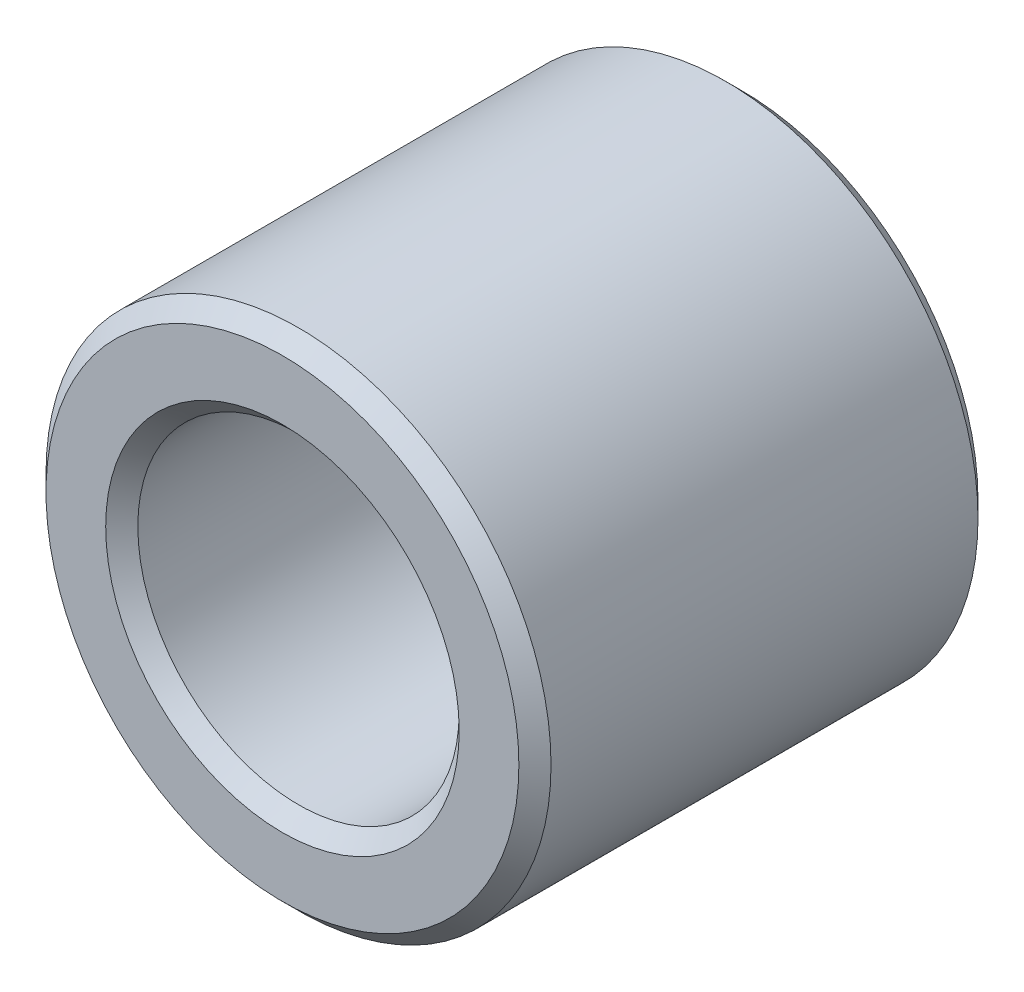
ISO-10303-21;
HEADER;
FILE_DESCRIPTION(('STEP AP214'),'2;1');
FILE_NAME('part.step','',(''),(''),'','','');
FILE_SCHEMA(('AUTOMOTIVE_DESIGN { 1 0 10303 214 1 1 1 1 }'));
ENDSEC;
DATA;
#1=APPLICATION_CONTEXT('core data for automotive mechanical design processes');
#2=APPLICATION_PROTOCOL_DEFINITION('international standard','automotive_design',2000,#1);
#3=PRODUCT_CONTEXT('',#1,'mechanical');
#4=PRODUCT('Part','Part','',(#3));
#5=PRODUCT_RELATED_PRODUCT_CATEGORY('part','',(#4));
#6=PRODUCT_DEFINITION_FORMATION('','',#4);
#7=PRODUCT_DEFINITION_CONTEXT('part definition',#1,'design');
#8=PRODUCT_DEFINITION('design','',#6,#7);
#9=PRODUCT_DEFINITION_SHAPE('','',#8);
#10=(LENGTH_UNIT() NAMED_UNIT(*) SI_UNIT(.MILLI.,.METRE.));
#11=(NAMED_UNIT(*) PLANE_ANGLE_UNIT() SI_UNIT($,.RADIAN.));
#12=(NAMED_UNIT(*) SI_UNIT($,.STERADIAN.) SOLID_ANGLE_UNIT());
#13=UNCERTAINTY_MEASURE_WITH_UNIT(LENGTH_MEASURE(1.E-05),#10,'distance_accuracy_value','');
#14=(GEOMETRIC_REPRESENTATION_CONTEXT(3) GLOBAL_UNCERTAINTY_ASSIGNED_CONTEXT((#13)) GLOBAL_UNIT_ASSIGNED_CONTEXT((#10,
#11,#12)) REPRESENTATION_CONTEXT('',''));
#15=CARTESIAN_POINT('',(0.,0.,0.));
#16=DIRECTION('',(0.,0.,1.));
#17=DIRECTION('',(1.,0.,0.));
#18=AXIS2_PLACEMENT_3D('',#15,#16,#17);
#19=CARTESIAN_POINT('',(0.,0.,50.));
#20=DIRECTION('',(0.,0.,1.));
#21=DIRECTION('',(1.,0.,0.));
#22=AXIS2_PLACEMENT_3D('',#19,#20,#21);
#23=PLANE('',#22);
#24=CARTESIAN_POINT('',(0.,0.,50.));
#25=DIRECTION('',(0.,0.,1.));
#26=DIRECTION('',(1.,0.,0.));
#27=AXIS2_PLACEMENT_3D('',#24,#25,#26);
#28=CIRCLE('',#27,38.5);
#29=CARTESIAN_POINT('',(38.5,0.,50.));
#30=VERTEX_POINT('',#29);
#31=EDGE_CURVE('E10',#30,#30,#28,.F.);
#32=ORIENTED_EDGE('',*,*,#31,.T.);
#33=EDGE_LOOP('',(#32));
#34=FACE_BOUND('',#33,.T.);
#35=CARTESIAN_POINT('',(0.,0.,50.));
#36=DIRECTION('',(0.,0.,1.));
#37=DIRECTION('',(1.,0.,0.));
#38=AXIS2_PLACEMENT_3D('',#35,#36,#37);
#39=CIRCLE('',#38,51.5);
#40=CARTESIAN_POINT('',(51.5,0.,50.));
#41=VERTEX_POINT('',#40);
#42=EDGE_CURVE('E45',#41,#41,#39,.T.);
#43=ORIENTED_EDGE('',*,*,#42,.T.);
#44=EDGE_LOOP('',(#43));
#45=FACE_BOUND('',#44,.T.);
#46=ADVANCED_FACE('F37',(#34,#45),#23,.T.);
#47=CARTESIAN_POINT('',(0.,0.,-50.));
#48=DIRECTION('',(0.,0.,1.));
#49=DIRECTION('',(1.,0.,0.));
#50=AXIS2_PLACEMENT_3D('',#47,#48,#49);
#51=PLANE('',#50);
#52=CARTESIAN_POINT('',(0.,0.,-50.));
#53=DIRECTION('',(0.,0.,1.));
#54=DIRECTION('',(1.,0.,0.));
#55=AXIS2_PLACEMENT_3D('',#52,#53,#54);
#56=CIRCLE('',#55,38.5);
#57=CARTESIAN_POINT('',(-38.5,0.,-50.));
#58=VERTEX_POINT('',#57);
#59=EDGE_CURVE('E70',#58,#58,#56,.T.);
#60=ORIENTED_EDGE('',*,*,#59,.T.);
#61=EDGE_LOOP('',(#60));
#62=FACE_BOUND('',#61,.T.);
#63=CARTESIAN_POINT('',(0.,0.,-50.));
#64=DIRECTION('',(0.,0.,1.));
#65=DIRECTION('',(1.,0.,0.));
#66=AXIS2_PLACEMENT_3D('',#63,#64,#65);
#67=CIRCLE('',#66,51.5);
#68=CARTESIAN_POINT('',(51.5,0.,-50.));
#69=VERTEX_POINT('',#68);
#70=EDGE_CURVE('E73',#69,#69,#67,.F.);
#71=ORIENTED_EDGE('',*,*,#70,.T.);
#72=EDGE_LOOP('',(#71));
#73=FACE_BOUND('',#72,.T.);
#74=ADVANCED_FACE('F78',(#62,#73),#51,.F.);
#75=CARTESIAN_POINT('',(0.,0.,50.));
#76=DIRECTION('',(0.,0.,-1.));
#77=DIRECTION('',(-1.,0.,0.));
#78=AXIS2_PLACEMENT_3D('',#75,#76,#77);
#79=CYLINDRICAL_SURFACE('',#78,55.);
#80=CARTESIAN_POINT('',(0.,0.,-46.5));
#81=DIRECTION('',(0.,0.,1.));
#82=DIRECTION('',(1.,0.,0.));
#83=AXIS2_PLACEMENT_3D('',#80,#81,#82);
#84=CIRCLE('',#83,55.);
#85=CARTESIAN_POINT('',(55.,0.,-46.5));
#86=VERTEX_POINT('',#85);
#87=EDGE_CURVE('E52',#86,#86,#84,.T.);
#88=ORIENTED_EDGE('',*,*,#87,.T.);
#89=EDGE_LOOP('',(#88));
#90=FACE_BOUND('',#89,.T.);
#91=CARTESIAN_POINT('',(0.,0.,46.5));
#92=DIRECTION('',(0.,0.,1.));
#93=DIRECTION('',(1.,0.,0.));
#94=AXIS2_PLACEMENT_3D('',#91,#92,#93);
#95=CIRCLE('',#94,55.);
#96=CARTESIAN_POINT('',(55.,0.,46.5));
#97=VERTEX_POINT('',#96);
#98=EDGE_CURVE('E58',#97,#97,#95,.F.);
#99=ORIENTED_EDGE('',*,*,#98,.T.);
#100=EDGE_LOOP('',(#99));
#101=FACE_BOUND('',#100,.T.);
#102=ADVANCED_FACE('F88',(#90,#101),#79,.T.);
#103=CARTESIAN_POINT('',(0.,0.,50.));
#104=DIRECTION('',(0.,0.,-1.));
#105=DIRECTION('',(-1.,0.,0.));
#106=AXIS2_PLACEMENT_3D('',#103,#104,#105);
#107=CYLINDRICAL_SURFACE('',#106,35.);
#108=CARTESIAN_POINT('',(0.,0.,-46.5));
#109=DIRECTION('',(0.,0.,1.));
#110=DIRECTION('',(1.,0.,0.));
#111=AXIS2_PLACEMENT_3D('',#108,#109,#110);
#112=CIRCLE('',#111,35.);
#113=CARTESIAN_POINT('',(-35.,0.,-46.5));
#114=VERTEX_POINT('',#113);
#115=EDGE_CURVE('E64',#114,#114,#112,.F.);
#116=CARTESIAN_POINT('',(0.,0.,46.5));
#117=DIRECTION('',(0.,0.,1.));
#118=DIRECTION('',(1.,0.,0.));
#119=AXIS2_PLACEMENT_3D('',#116,#117,#118);
#120=CIRCLE('',#119,35.);
#121=CARTESIAN_POINT('',(-35.,0.,46.5));
#122=VERTEX_POINT('',#121);
#123=EDGE_CURVE('E67',#122,#122,#120,.T.);
#124=CARTESIAN_POINT('',(-35.,0.,-46.5));
#125=CARTESIAN_POINT('',(-35.,0.,-45.53125));
#126=CARTESIAN_POINT('',(-35.,0.,-44.5625));
#127=CARTESIAN_POINT('',(-35.,0.,-42.625));
#128=CARTESIAN_POINT('',(-35.,0.,-41.65625));
#129=CARTESIAN_POINT('',(-35.,0.,-39.71875));
#130=CARTESIAN_POINT('',(-35.,0.,-38.75));
#131=CARTESIAN_POINT('',(-35.,0.,-36.8125));
#132=CARTESIAN_POINT('',(-35.,0.,-35.84375));
#133=CARTESIAN_POINT('',(-35.,0.,-33.90625));
#134=CARTESIAN_POINT('',(-35.,0.,-32.9375));
#135=CARTESIAN_POINT('',(-35.,0.,-31.));
#136=CARTESIAN_POINT('',(-35.,0.,-30.03125));
#137=CARTESIAN_POINT('',(-35.,0.,-28.09375));
#138=CARTESIAN_POINT('',(-35.,0.,-27.125));
#139=CARTESIAN_POINT('',(-35.,0.,-25.1875));
#140=CARTESIAN_POINT('',(-35.,0.,-24.21875));
#141=CARTESIAN_POINT('',(-35.,0.,-22.28125));
#142=CARTESIAN_POINT('',(-35.,0.,-21.3125));
#143=CARTESIAN_POINT('',(-35.,0.,-19.375));
#144=CARTESIAN_POINT('',(-35.,0.,-18.40625));
#145=CARTESIAN_POINT('',(-35.,0.,-16.46875));
#146=CARTESIAN_POINT('',(-35.,0.,-15.5));
#147=CARTESIAN_POINT('',(-35.,0.,-13.5625));
#148=CARTESIAN_POINT('',(-35.,0.,-12.59375));
#149=CARTESIAN_POINT('',(-35.,0.,-10.65625));
#150=CARTESIAN_POINT('',(-35.,0.,-9.6875));
#151=CARTESIAN_POINT('',(-35.,0.,-7.75));
#152=CARTESIAN_POINT('',(-35.,0.,-6.78125000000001));
#153=CARTESIAN_POINT('',(-35.,0.,-4.84375000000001));
#154=CARTESIAN_POINT('',(-35.,0.,-3.87500000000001));
#155=CARTESIAN_POINT('',(-35.,0.,-1.93750000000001));
#156=CARTESIAN_POINT('',(-35.,0.,-0.968750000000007));
#157=CARTESIAN_POINT('',(-35.,0.,0.968749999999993));
#158=CARTESIAN_POINT('',(-35.,0.,1.93749999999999));
#159=CARTESIAN_POINT('',(-35.,0.,3.87499999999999));
#160=CARTESIAN_POINT('',(-35.,0.,4.84374999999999));
#161=CARTESIAN_POINT('',(-35.,0.,6.78124999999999));
#162=CARTESIAN_POINT('',(-35.,0.,7.74999999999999));
#163=CARTESIAN_POINT('',(-35.,0.,9.68749999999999));
#164=CARTESIAN_POINT('',(-35.,0.,10.65625));
#165=CARTESIAN_POINT('',(-35.,0.,12.59375));
#166=CARTESIAN_POINT('',(-35.,0.,13.5625));
#167=CARTESIAN_POINT('',(-35.,0.,15.5));
#168=CARTESIAN_POINT('',(-35.,0.,16.46875));
#169=CARTESIAN_POINT('',(-35.,0.,18.40625));
#170=CARTESIAN_POINT('',(-35.,0.,19.375));
#171=CARTESIAN_POINT('',(-35.,0.,21.3125));
#172=CARTESIAN_POINT('',(-35.,0.,22.28125));
#173=CARTESIAN_POINT('',(-35.,0.,24.21875));
#174=CARTESIAN_POINT('',(-35.,0.,25.1875));
#175=CARTESIAN_POINT('',(-35.,0.,27.125));
#176=CARTESIAN_POINT('',(-35.,0.,28.09375));
#177=CARTESIAN_POINT('',(-35.,0.,30.03125));
#178=CARTESIAN_POINT('',(-35.,0.,31.));
#179=CARTESIAN_POINT('',(-35.,0.,32.9375));
#180=CARTESIAN_POINT('',(-35.,0.,33.90625));
#181=CARTESIAN_POINT('',(-35.,0.,35.84375));
#182=CARTESIAN_POINT('',(-35.,0.,36.8125));
#183=CARTESIAN_POINT('',(-35.,0.,38.75));
#184=CARTESIAN_POINT('',(-35.,0.,39.71875));
#185=CARTESIAN_POINT('',(-35.,0.,41.65625));
#186=CARTESIAN_POINT('',(-35.,0.,42.625));
#187=CARTESIAN_POINT('',(-35.,0.,44.5625));
#188=CARTESIAN_POINT('',(-35.,0.,45.53125));
#189=CARTESIAN_POINT('',(-35.,0.,46.5));
#190=B_SPLINE_CURVE_WITH_KNOTS('',3,(#124,#125,#126,#127,#128,#129,#130,#131,#132,#133,#134,
#135,#136,#137,#138,#139,#140,#141,#142,#143,#144,#145,#146,#147,#148,#149,#150,#151,#152,#153,
#154,#155,#156,#157,#158,#159,#160,#161,#162,#163,#164,#165,#166,#167,#168,#169,#170,#171,#172,
#173,#174,#175,#176,#177,#178,#179,#180,#181,#182,#183,#184,#185,#186,#187,#188,#189),
.UNSPECIFIED.,.F.,.F.,(4,2,2,2,2,2,2,2,2,2,2,2,2,2,2,2,2,2,2,2,2,2,2,2,2,2,2,2,2,2,2,2,4),(0.,
2.90625,5.8125,8.71875,11.625,14.53125,17.4375,20.34375,23.25,26.15625,29.0625,31.96875,34.875,
37.78125,40.6875,43.59375,46.5,49.40625,52.3125,55.21875,58.125,61.03125,63.9375,66.84375,69.75,
72.65625,75.5625,78.46875,81.375,84.28125,87.1875,90.09375,93.),.UNSPECIFIED.);
#191=EDGE_CURVE('BSEAM91',#114,#122,#190,.T.);
#192=ORIENTED_EDGE('',*,*,#115,.T.);
#193=ORIENTED_EDGE('',*,*,#123,.T.);
#194=ORIENTED_EDGE('',*,*,#191,.T.);
#195=ORIENTED_EDGE('',*,*,#191,.F.);
#196=EDGE_LOOP('',(#192,#194,#193,#195));
#197=FACE_BOUND('',#196,.T.);
#198=ADVANCED_FACE('F91',(#197),#107,.F.);
#199=CARTESIAN_POINT('',(0.,0.,-50.));
#200=DIRECTION('',(0.,0.,-1.));
#201=DIRECTION('',(-1.,0.,0.));
#202=AXIS2_PLACEMENT_3D('',#199,#200,#201);
#203=CONICAL_SURFACE('',#202,38.5,0.785398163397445);
#204=CARTESIAN_POINT('',(-35.,0.,-46.5));
#205=CARTESIAN_POINT('',(-35.0364583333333,0.,-46.5364583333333));
#206=CARTESIAN_POINT('',(-35.0729166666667,0.,-46.5729166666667));
#207=CARTESIAN_POINT('',(-35.1458333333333,0.,-46.6458333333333));
#208=CARTESIAN_POINT('',(-35.1822916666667,0.,-46.6822916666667));
#209=CARTESIAN_POINT('',(-35.2552083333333,0.,-46.7552083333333));
#210=CARTESIAN_POINT('',(-35.2916666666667,0.,-46.7916666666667));
#211=CARTESIAN_POINT('',(-35.3645833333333,0.,-46.8645833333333));
#212=CARTESIAN_POINT('',(-35.4010416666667,0.,-46.9010416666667));
#213=CARTESIAN_POINT('',(-35.4739583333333,0.,-46.9739583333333));
#214=CARTESIAN_POINT('',(-35.5104166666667,0.,-47.0104166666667));
#215=CARTESIAN_POINT('',(-35.5833333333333,0.,-47.0833333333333));
#216=CARTESIAN_POINT('',(-35.6197916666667,0.,-47.1197916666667));
#217=CARTESIAN_POINT('',(-35.6927083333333,0.,-47.1927083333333));
#218=CARTESIAN_POINT('',(-35.7291666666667,0.,-47.2291666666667));
#219=CARTESIAN_POINT('',(-35.8020833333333,0.,-47.3020833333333));
#220=CARTESIAN_POINT('',(-35.8385416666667,0.,-47.3385416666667));
#221=CARTESIAN_POINT('',(-35.9114583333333,0.,-47.4114583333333));
#222=CARTESIAN_POINT('',(-35.9479166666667,0.,-47.4479166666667));
#223=CARTESIAN_POINT('',(-36.0208333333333,0.,-47.5208333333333));
#224=CARTESIAN_POINT('',(-36.0572916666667,0.,-47.5572916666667));
#225=CARTESIAN_POINT('',(-36.1302083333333,0.,-47.6302083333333));
#226=CARTESIAN_POINT('',(-36.1666666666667,0.,-47.6666666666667));
#227=CARTESIAN_POINT('',(-36.2395833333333,0.,-47.7395833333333));
#228=CARTESIAN_POINT('',(-36.2760416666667,0.,-47.7760416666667));
#229=CARTESIAN_POINT('',(-36.3489583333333,0.,-47.8489583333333));
#230=CARTESIAN_POINT('',(-36.3854166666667,0.,-47.8854166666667));
#231=CARTESIAN_POINT('',(-36.4583333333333,0.,-47.9583333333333));
#232=CARTESIAN_POINT('',(-36.4947916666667,0.,-47.9947916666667));
#233=CARTESIAN_POINT('',(-36.5677083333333,0.,-48.0677083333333));
#234=CARTESIAN_POINT('',(-36.6041666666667,0.,-48.1041666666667));
#235=CARTESIAN_POINT('',(-36.6770833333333,0.,-48.1770833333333));
#236=CARTESIAN_POINT('',(-36.7135416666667,0.,-48.2135416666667));
#237=CARTESIAN_POINT('',(-36.7864583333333,0.,-48.2864583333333));
#238=CARTESIAN_POINT('',(-36.8229166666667,0.,-48.3229166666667));
#239=CARTESIAN_POINT('',(-36.8958333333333,0.,-48.3958333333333));
#240=CARTESIAN_POINT('',(-36.9322916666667,0.,-48.4322916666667));
#241=CARTESIAN_POINT('',(-37.0052083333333,0.,-48.5052083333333));
#242=CARTESIAN_POINT('',(-37.0416666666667,0.,-48.5416666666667));
#243=CARTESIAN_POINT('',(-37.1145833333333,0.,-48.6145833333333));
#244=CARTESIAN_POINT('',(-37.1510416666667,0.,-48.6510416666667));
#245=CARTESIAN_POINT('',(-37.2239583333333,0.,-48.7239583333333));
#246=CARTESIAN_POINT('',(-37.2604166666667,0.,-48.7604166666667));
#247=CARTESIAN_POINT('',(-37.3333333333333,0.,-48.8333333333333));
#248=CARTESIAN_POINT('',(-37.3697916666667,0.,-48.8697916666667));
#249=CARTESIAN_POINT('',(-37.4427083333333,0.,-48.9427083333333));
#250=CARTESIAN_POINT('',(-37.4791666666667,0.,-48.9791666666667));
#251=CARTESIAN_POINT('',(-37.5520833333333,0.,-49.0520833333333));
#252=CARTESIAN_POINT('',(-37.5885416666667,0.,-49.0885416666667));
#253=CARTESIAN_POINT('',(-37.6614583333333,0.,-49.1614583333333));
#254=CARTESIAN_POINT('',(-37.6979166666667,0.,-49.1979166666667));
#255=CARTESIAN_POINT('',(-37.7708333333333,0.,-49.2708333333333));
#256=CARTESIAN_POINT('',(-37.8072916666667,0.,-49.3072916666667));
#257=CARTESIAN_POINT('',(-37.8802083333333,0.,-49.3802083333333));
#258=CARTESIAN_POINT('',(-37.9166666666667,0.,-49.4166666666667));
#259=CARTESIAN_POINT('',(-37.9895833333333,0.,-49.4895833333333));
#260=CARTESIAN_POINT('',(-38.0260416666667,0.,-49.5260416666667));
#261=CARTESIAN_POINT('',(-38.0989583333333,0.,-49.5989583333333));
#262=CARTESIAN_POINT('',(-38.1354166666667,0.,-49.6354166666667));
#263=CARTESIAN_POINT('',(-38.2083333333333,0.,-49.7083333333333));
#264=CARTESIAN_POINT('',(-38.2447916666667,0.,-49.7447916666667));
#265=CARTESIAN_POINT('',(-38.3177083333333,0.,-49.8177083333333));
#266=CARTESIAN_POINT('',(-38.3541666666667,0.,-49.8541666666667));
#267=CARTESIAN_POINT('',(-38.4270833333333,0.,-49.9270833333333));
#268=CARTESIAN_POINT('',(-38.4635416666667,0.,-49.9635416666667));
#269=CARTESIAN_POINT('',(-38.5,0.,-50.));
#270=B_SPLINE_CURVE_WITH_KNOTS('',3,(#204,#205,#206,#207,#208,#209,#210,#211,#212,#213,#214,
#215,#216,#217,#218,#219,#220,#221,#222,#223,#224,#225,#226,#227,#228,#229,#230,#231,#232,#233,
#234,#235,#236,#237,#238,#239,#240,#241,#242,#243,#244,#245,#246,#247,#248,#249,#250,#251,#252,
#253,#254,#255,#256,#257,#258,#259,#260,#261,#262,#263,#264,#265,#266,#267,#268,#269),
.UNSPECIFIED.,.F.,.F.,(4,2,2,2,2,2,2,2,2,2,2,2,2,2,2,2,2,2,2,2,2,2,2,2,2,2,2,2,2,2,2,2,4),(0.,
0.15467960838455,0.30935921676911,0.46403882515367,0.618718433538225,0.77339804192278,
0.928077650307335,1.08275725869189,1.23743686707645,1.392116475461,1.54679608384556,
1.70147569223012,1.85615530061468,2.01083490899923,2.16551451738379,2.32019412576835,
2.47487373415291,2.62955334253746,2.78423295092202,2.93891255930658,3.09359216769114,
3.24827177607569,3.40295138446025,3.55763099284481,3.71231060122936,3.86699020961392,
4.02166981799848,4.17634942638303,4.33102903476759,4.48570864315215,4.6403882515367,
4.79506785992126,4.94974746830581),.UNSPECIFIED.);
#271=EDGE_CURVE('BSEAM84',#114,#58,#270,.T.);
#272=ORIENTED_EDGE('',*,*,#115,.F.);
#273=ORIENTED_EDGE('',*,*,#59,.F.);
#274=ORIENTED_EDGE('',*,*,#271,.T.);
#275=ORIENTED_EDGE('',*,*,#271,.F.);
#276=EDGE_LOOP('',(#272,#274,#273,#275));
#277=FACE_BOUND('',#276,.T.);
#278=ADVANCED_FACE('F84',(#277),#203,.F.);
#279=CARTESIAN_POINT('',(0.,0.,-46.5));
#280=DIRECTION('',(0.,0.,1.));
#281=DIRECTION('',(1.,0.,0.));
#282=AXIS2_PLACEMENT_3D('',#279,#280,#281);
#283=CONICAL_SURFACE('',#282,55.,0.785398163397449);
#284=CARTESIAN_POINT('',(51.5,0.,-50.));
#285=CARTESIAN_POINT('',(51.5364583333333,0.,-49.9635416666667));
#286=CARTESIAN_POINT('',(51.5729166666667,0.,-49.9270833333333));
#287=CARTESIAN_POINT('',(51.6458333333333,0.,-49.8541666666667));
#288=CARTESIAN_POINT('',(51.6822916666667,0.,-49.8177083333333));
#289=CARTESIAN_POINT('',(51.7552083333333,0.,-49.7447916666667));
#290=CARTESIAN_POINT('',(51.7916666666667,0.,-49.7083333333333));
#291=CARTESIAN_POINT('',(51.8645833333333,0.,-49.6354166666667));
#292=CARTESIAN_POINT('',(51.9010416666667,0.,-49.5989583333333));
#293=CARTESIAN_POINT('',(51.9739583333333,0.,-49.5260416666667));
#294=CARTESIAN_POINT('',(52.0104166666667,0.,-49.4895833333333));
#295=CARTESIAN_POINT('',(52.0833333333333,0.,-49.4166666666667));
#296=CARTESIAN_POINT('',(52.1197916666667,0.,-49.3802083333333));
#297=CARTESIAN_POINT('',(52.1927083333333,0.,-49.3072916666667));
#298=CARTESIAN_POINT('',(52.2291666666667,0.,-49.2708333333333));
#299=CARTESIAN_POINT('',(52.3020833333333,0.,-49.1979166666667));
#300=CARTESIAN_POINT('',(52.3385416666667,0.,-49.1614583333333));
#301=CARTESIAN_POINT('',(52.4114583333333,0.,-49.0885416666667));
#302=CARTESIAN_POINT('',(52.4479166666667,0.,-49.0520833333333));
#303=CARTESIAN_POINT('',(52.5208333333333,0.,-48.9791666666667));
#304=CARTESIAN_POINT('',(52.5572916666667,0.,-48.9427083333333));
#305=CARTESIAN_POINT('',(52.6302083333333,0.,-48.8697916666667));
#306=CARTESIAN_POINT('',(52.6666666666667,0.,-48.8333333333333));
#307=CARTESIAN_POINT('',(52.7395833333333,0.,-48.7604166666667));
#308=CARTESIAN_POINT('',(52.7760416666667,0.,-48.7239583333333));
#309=CARTESIAN_POINT('',(52.8489583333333,0.,-48.6510416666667));
#310=CARTESIAN_POINT('',(52.8854166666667,0.,-48.6145833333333));
#311=CARTESIAN_POINT('',(52.9583333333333,0.,-48.5416666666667));
#312=CARTESIAN_POINT('',(52.9947916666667,0.,-48.5052083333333));
#313=CARTESIAN_POINT('',(53.0677083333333,0.,-48.4322916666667));
#314=CARTESIAN_POINT('',(53.1041666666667,0.,-48.3958333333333));
#315=CARTESIAN_POINT('',(53.1770833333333,0.,-48.3229166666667));
#316=CARTESIAN_POINT('',(53.2135416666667,0.,-48.2864583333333));
#317=CARTESIAN_POINT('',(53.2864583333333,0.,-48.2135416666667));
#318=CARTESIAN_POINT('',(53.3229166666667,0.,-48.1770833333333));
#319=CARTESIAN_POINT('',(53.3958333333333,0.,-48.1041666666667));
#320=CARTESIAN_POINT('',(53.4322916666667,0.,-48.0677083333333));
#321=CARTESIAN_POINT('',(53.5052083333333,0.,-47.9947916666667));
#322=CARTESIAN_POINT('',(53.5416666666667,0.,-47.9583333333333));
#323=CARTESIAN_POINT('',(53.6145833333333,0.,-47.8854166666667));
#324=CARTESIAN_POINT('',(53.6510416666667,0.,-47.8489583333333));
#325=CARTESIAN_POINT('',(53.7239583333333,0.,-47.7760416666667));
#326=CARTESIAN_POINT('',(53.7604166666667,0.,-47.7395833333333));
#327=CARTESIAN_POINT('',(53.8333333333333,0.,-47.6666666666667));
#328=CARTESIAN_POINT('',(53.8697916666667,0.,-47.6302083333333));
#329=CARTESIAN_POINT('',(53.9427083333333,0.,-47.5572916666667));
#330=CARTESIAN_POINT('',(53.9791666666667,0.,-47.5208333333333));
#331=CARTESIAN_POINT('',(54.0520833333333,0.,-47.4479166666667));
#332=CARTESIAN_POINT('',(54.0885416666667,0.,-47.4114583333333));
#333=CARTESIAN_POINT('',(54.1614583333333,0.,-47.3385416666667));
#334=CARTESIAN_POINT('',(54.1979166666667,0.,-47.3020833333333));
#335=CARTESIAN_POINT('',(54.2708333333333,0.,-47.2291666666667));
#336=CARTESIAN_POINT('',(54.3072916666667,0.,-47.1927083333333));
#337=CARTESIAN_POINT('',(54.3802083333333,0.,-47.1197916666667));
#338=CARTESIAN_POINT('',(54.4166666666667,0.,-47.0833333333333));
#339=CARTESIAN_POINT('',(54.4895833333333,0.,-47.0104166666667));
#340=CARTESIAN_POINT('',(54.5260416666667,0.,-46.9739583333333));
#341=CARTESIAN_POINT('',(54.5989583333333,0.,-46.9010416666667));
#342=CARTESIAN_POINT('',(54.6354166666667,0.,-46.8645833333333));
#343=CARTESIAN_POINT('',(54.7083333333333,0.,-46.7916666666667));
#344=CARTESIAN_POINT('',(54.7447916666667,0.,-46.7552083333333));
#345=CARTESIAN_POINT('',(54.8177083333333,0.,-46.6822916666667));
#346=CARTESIAN_POINT('',(54.8541666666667,0.,-46.6458333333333));
#347=CARTESIAN_POINT('',(54.9270833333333,0.,-46.5729166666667));
#348=CARTESIAN_POINT('',(54.9635416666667,0.,-46.5364583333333));
#349=CARTESIAN_POINT('',(55.,0.,-46.5));
#350=B_SPLINE_CURVE_WITH_KNOTS('',3,(#284,#285,#286,#287,#288,#289,#290,#291,#292,#293,#294,
#295,#296,#297,#298,#299,#300,#301,#302,#303,#304,#305,#306,#307,#308,#309,#310,#311,#312,#313,
#314,#315,#316,#317,#318,#319,#320,#321,#322,#323,#324,#325,#326,#327,#328,#329,#330,#331,#332,
#333,#334,#335,#336,#337,#338,#339,#340,#341,#342,#343,#344,#345,#346,#347,#348,#349),
.UNSPECIFIED.,.F.,.F.,(4,2,2,2,2,2,2,2,2,2,2,2,2,2,2,2,2,2,2,2,2,2,2,2,2,2,2,2,2,2,2,2,4),(0.,
0.15467960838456,0.30935921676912,0.46403882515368,0.61871843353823,0.77339804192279,
0.928077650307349,1.08275725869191,1.23743686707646,1.39211647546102,1.54679608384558,
1.70147569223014,1.85615530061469,2.01083490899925,2.16551451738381,2.32019412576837,
2.47487373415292,2.62955334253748,2.78423295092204,2.9389125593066,3.09359216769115,
3.24827177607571,3.40295138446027,3.55763099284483,3.71231060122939,3.86699020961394,
4.0216698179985,4.17634942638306,4.33102903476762,4.48570864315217,4.64038825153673,
4.79506785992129,4.94974746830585),.UNSPECIFIED.);
#351=EDGE_CURVE('BSEAM80',#69,#86,#350,.T.);
#352=ORIENTED_EDGE('',*,*,#70,.F.);
#353=ORIENTED_EDGE('',*,*,#87,.F.);
#354=ORIENTED_EDGE('',*,*,#351,.T.);
#355=ORIENTED_EDGE('',*,*,#351,.F.);
#356=EDGE_LOOP('',(#352,#354,#353,#355));
#357=FACE_BOUND('',#356,.T.);
#358=ADVANCED_FACE('F80',(#357),#283,.T.);
#359=CARTESIAN_POINT('',(0.,0.,46.5));
#360=DIRECTION('',(0.,0.,1.));
#361=DIRECTION('',(1.,0.,0.));
#362=AXIS2_PLACEMENT_3D('',#359,#360,#361);
#363=CONICAL_SURFACE('',#362,35.,0.78539816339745);
#364=ORIENTED_EDGE('',*,*,#31,.F.);
#365=EDGE_LOOP('',(#364));
#366=FACE_BOUND('',#365,.T.);
#367=ORIENTED_EDGE('',*,*,#123,.F.);
#368=EDGE_LOOP('',(#367));
#369=FACE_BOUND('',#368,.T.);
#370=ADVANCED_FACE('F83',(#366,#369),#363,.F.);
#371=CARTESIAN_POINT('',(0.,0.,50.));
#372=DIRECTION('',(0.,0.,-1.));
#373=DIRECTION('',(-1.,0.,0.));
#374=AXIS2_PLACEMENT_3D('',#371,#372,#373);
#375=CONICAL_SURFACE('',#374,51.5,0.785398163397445);
#376=ORIENTED_EDGE('',*,*,#98,.F.);
#377=EDGE_LOOP('',(#376));
#378=FACE_BOUND('',#377,.T.);
#379=ORIENTED_EDGE('',*,*,#42,.F.);
#380=EDGE_LOOP('',(#379));
#381=FACE_BOUND('',#380,.T.);
#382=ADVANCED_FACE('F39',(#378,#381),#375,.T.);
#383=CLOSED_SHELL('',(#46,#74,#102,#198,#278,#358,#370,#382));
#384=MANIFOLD_SOLID_BREP('B2',#383);
#385=ADVANCED_BREP_SHAPE_REPRESENTATION('',(#18,#384),#14);
#386=SHAPE_DEFINITION_REPRESENTATION(#9,#385);
ENDSEC;
END-ISO-10303-21;
